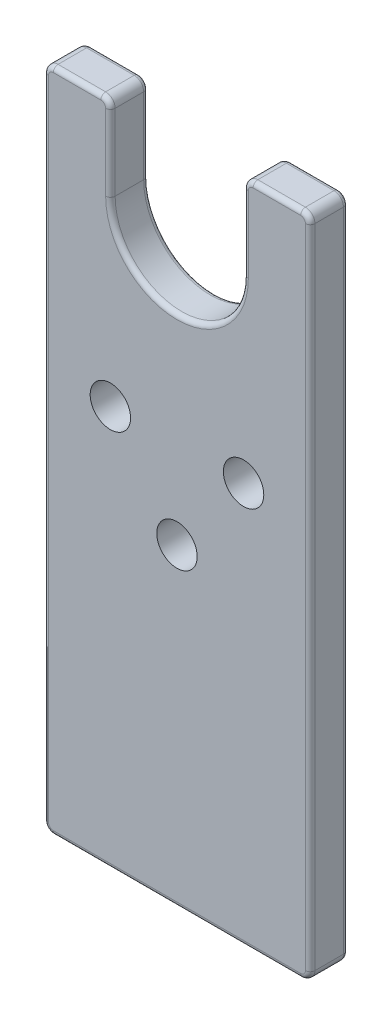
from build123d import *

# Parameters (mm, degrees)
SKETCH1_R          = 6.7437
BASE_EXTRUDE_DEPTH = 12.7
FILLET1_R          = 3.175
FILLET2_R          = 1.5875


with BuildPart() as part:
    # Sketch1 → Base-Extrude (new body)
    with BuildSketch(Plane.XY):
        with BuildLine():
            Line((0, 0), (88.9, 0))
            Line((88.9, 0), (88.9, 222.25))
            Line((88.9, 222.25), (66.675, 222.25))
            Line((66.675, 222.25), (66.675, 193.675))
            ThreePointArc((66.675, 193.675), (44.45, 171.45), (22.225, 193.675))
            Line((22.225, 193.675), (22.225, 222.25))
            Line((22.225, 222.25), (0, 222.25))
            Line((0, 222.25), (0, 0))
        make_face()
        with Locations((22.225, 133.739183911)):
            Circle(SKETCH1_R, mode=Mode.SUBTRACT)
        with Locations((44.45, 104.775)):
            Circle(SKETCH1_R, mode=Mode.SUBTRACT)
        with Locations((66.675, 133.739183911)):
            Circle(SKETCH1_R, mode=Mode.SUBTRACT)
    extrude(amount=BASE_EXTRUDE_DEPTH)

    # Fillet1
    fillet1_edges = [part.edges().sort_by_distance(p)[0] for p in [
        (0, 0, 6.35),
        (88.9, 0, 6.35),
        (88.9, 222.25, 6.35),
        (66.675, 222.25, 6.35),
        (22.225, 222.25, 6.35),
        (0, 222.25, 6.35),
    ]]
    fillet(fillet1_edges, radius=FILLET1_R)

    # Fillet2
    fillet2_edges = [part.edges().sort_by_distance(p)[0] for p in [
        (44.45, 171.45, 12.7),
        (11.1125, 222.25, 0),
        (11.1125, 222.25, 12.7),
        (0, 111.125, 0),
        (22.225, 206.375, 0),
        (66.675, 206.375, 0),
        (77.7875, 222.25, 0),
        (88.9, 111.125, 0),
        (44.45, 0, 0),
        (0.92993597, 0.92993597, 0),
        (87.97006403, 0.92993597, 0),
        (87.97006403, 221.32006403, 0),
        (0.92993597, 221.32006403, 0),
        (67.60493597, 221.32006403, 0),
        (21.29506403, 221.32006403, 0),
        (22.225, 206.375, 12.7),
        (0, 111.125, 12.7),
        (44.45, 0, 12.7),
        (88.9, 111.125, 12.7),
        (77.7875, 222.25, 12.7),
        (66.675, 206.375, 12.7),
        (0.92993597, 0.92993597, 12.7),
        (87.97006403, 0.92993597, 12.7),
        (87.97006403, 221.32006403, 12.7),
        (0.92993597, 221.32006403, 12.7),
        (67.60493597, 221.32006403, 12.7),
        (21.29506403, 221.32006403, 12.7),
        (44.45, 171.45, 0),
    ]]
    fillet(fillet2_edges, radius=FILLET2_R)


solid = part.part
